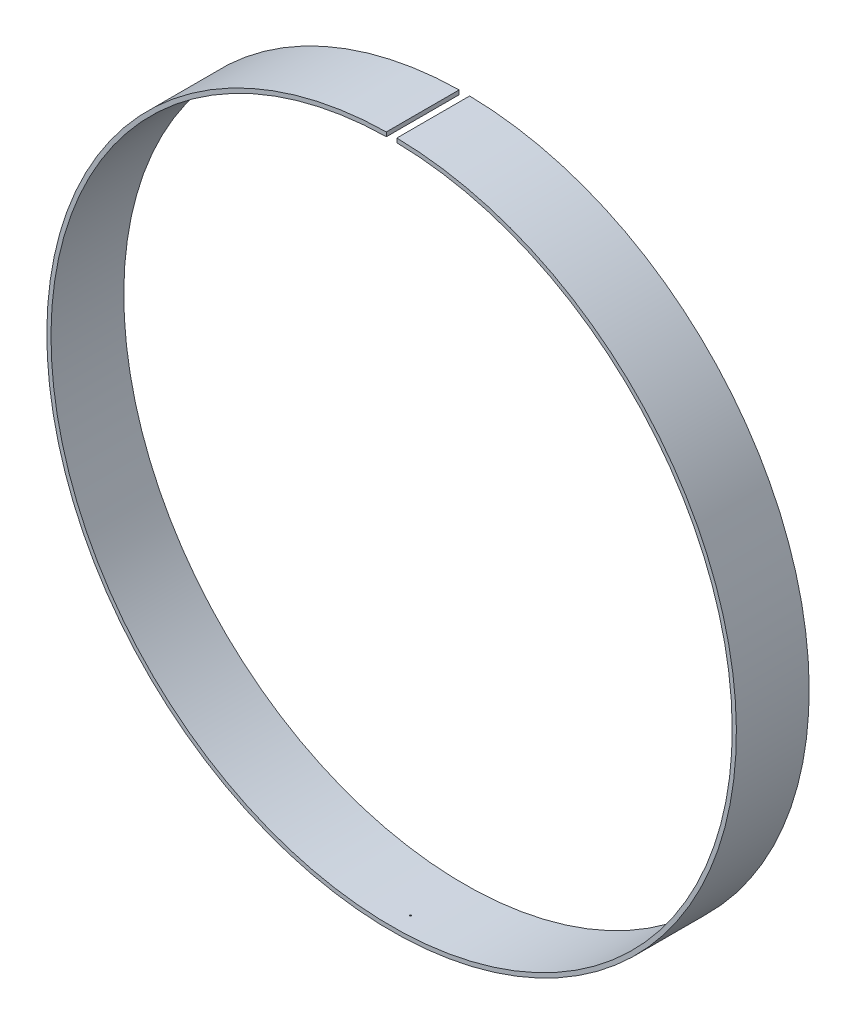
ISO-10303-21;
HEADER;
FILE_DESCRIPTION(('STEP AP214'),'2;1');
FILE_NAME('part.step','',(''),(''),'','','');
FILE_SCHEMA(('AUTOMOTIVE_DESIGN { 1 0 10303 214 1 1 1 1 }'));
ENDSEC;
DATA;
#1=APPLICATION_CONTEXT('core data for automotive mechanical design processes');
#2=APPLICATION_PROTOCOL_DEFINITION('international standard','automotive_design',2000,#1);
#3=PRODUCT_CONTEXT('',#1,'mechanical');
#4=PRODUCT('Part','Part','',(#3));
#5=PRODUCT_RELATED_PRODUCT_CATEGORY('part','',(#4));
#6=PRODUCT_DEFINITION_FORMATION('','',#4);
#7=PRODUCT_DEFINITION_CONTEXT('part definition',#1,'design');
#8=PRODUCT_DEFINITION('design','',#6,#7);
#9=PRODUCT_DEFINITION_SHAPE('','',#8);
#10=(LENGTH_UNIT() NAMED_UNIT(*) SI_UNIT(.MILLI.,.METRE.));
#11=(NAMED_UNIT(*) PLANE_ANGLE_UNIT() SI_UNIT($,.RADIAN.));
#12=(NAMED_UNIT(*) SI_UNIT($,.STERADIAN.) SOLID_ANGLE_UNIT());
#13=UNCERTAINTY_MEASURE_WITH_UNIT(LENGTH_MEASURE(1.E-05),#10,'distance_accuracy_value','');
#14=(GEOMETRIC_REPRESENTATION_CONTEXT(3) GLOBAL_UNCERTAINTY_ASSIGNED_CONTEXT((#13)) GLOBAL_UNIT_ASSIGNED_CONTEXT((#10,
#11,#12)) REPRESENTATION_CONTEXT('',''));
#15=CARTESIAN_POINT('',(0.,0.,0.));
#16=DIRECTION('',(0.,0.,1.));
#17=DIRECTION('',(1.,0.,0.));
#18=AXIS2_PLACEMENT_3D('',#15,#16,#17);
#19=CARTESIAN_POINT('',(0.,0.,-70.));
#20=DIRECTION('',(0.,0.,1.));
#21=DIRECTION('',(1.,0.,0.));
#22=AXIS2_PLACEMENT_3D('',#19,#20,#21);
#23=CYLINDRICAL_SURFACE('',#22,331.5);
#24=CARTESIAN_POINT('',(0.,0.,0.));
#25=DIRECTION('',(0.,0.,1.));
#26=DIRECTION('',(1.,0.,0.));
#27=AXIS2_PLACEMENT_3D('',#24,#25,#26);
#28=CIRCLE('',#27,331.5);
#29=CARTESIAN_POINT('',(-5.06106870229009,331.461363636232,0.));
#30=VERTEX_POINT('',#29);
#31=CARTESIAN_POINT('',(5.06106870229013,331.461363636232,0.));
#32=VERTEX_POINT('',#31);
#33=EDGE_CURVE('E117',#30,#32,#28,.T.);
#34=ORIENTED_EDGE('',*,*,#33,.F.);
#35=DIRECTION('',(0.,0.,1.));
#36=VECTOR('',#35,1.);
#37=CARTESIAN_POINT('',(-5.06106870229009,331.461363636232,-70.));
#38=LINE('',#37,#36);
#39=CARTESIAN_POINT('',(-5.06106870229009,331.461363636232,-70.));
#40=VERTEX_POINT('',#39);
#41=EDGE_CURVE('E11',#40,#30,#38,.T.);
#42=ORIENTED_EDGE('',*,*,#41,.F.);
#43=CARTESIAN_POINT('',(0.,0.,-70.));
#44=DIRECTION('',(0.,0.,1.));
#45=DIRECTION('',(1.,0.,0.));
#46=AXIS2_PLACEMENT_3D('',#43,#44,#45);
#47=CIRCLE('',#46,331.5);
#48=CARTESIAN_POINT('',(5.06106870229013,331.461363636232,-70.));
#49=VERTEX_POINT('',#48);
#50=EDGE_CURVE('E109',#40,#49,#47,.T.);
#51=ORIENTED_EDGE('',*,*,#50,.T.);
#52=DIRECTION('',(0.,0.,1.));
#53=VECTOR('',#52,1.);
#54=CARTESIAN_POINT('',(5.06106870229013,331.461363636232,-70.));
#55=LINE('',#54,#53);
#56=EDGE_CURVE('E47',#49,#32,#55,.T.);
#57=ORIENTED_EDGE('',*,*,#56,.T.);
#58=EDGE_LOOP('',(#34,#42,#51,#57));
#59=FACE_BOUND('',#58,.T.);
#60=CARTESIAN_POINT('',(0.,-331.5,-19.1724665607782));
#61=CARTESIAN_POINT('',(0.0392523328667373,-331.499999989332,-19.1724690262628));
#62=CARTESIAN_POINT('',(0.0785393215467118,-331.499992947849,-19.1758806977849));
#63=CARTESIAN_POINT('',(0.155980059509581,-331.49996557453,-19.189386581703));
#64=CARTESIAN_POINT('',(0.194132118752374,-331.499945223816,-19.1994902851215));
#65=CARTESIAN_POINT('',(0.268107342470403,-331.499893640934,-19.2259120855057));
#66=CARTESIAN_POINT('',(0.303935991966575,-331.499862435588,-19.2422148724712));
#67=CARTESIAN_POINT('',(0.372470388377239,-331.499792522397,-19.2803852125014));
#68=CARTESIAN_POINT('',(0.405176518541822,-331.499753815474,-19.3022520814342));
#69=CARTESIAN_POINT('',(0.467955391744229,-331.499671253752,-19.3517012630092));
#70=CARTESIAN_POINT('',(0.497882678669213,-331.499627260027,-19.3794677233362));
#71=CARTESIAN_POINT('',(0.553111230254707,-331.499539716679,-19.4392656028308));
#72=CARTESIAN_POINT('',(0.578410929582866,-331.499496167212,-19.4712984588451));
#73=CARTESIAN_POINT('',(0.626027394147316,-331.499409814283,-19.5417076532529));
#74=CARTESIAN_POINT('',(0.647885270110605,-331.499367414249,-19.5803942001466));
#75=CARTESIAN_POINT('',(0.685403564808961,-331.49929196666,-19.6606614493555));
#76=CARTESIAN_POINT('',(0.701061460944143,-331.499258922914,-19.7022433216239));
#77=CARTESIAN_POINT('',(0.727120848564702,-331.499202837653,-19.7910374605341));
#78=CARTESIAN_POINT('',(0.736935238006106,-331.499180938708,-19.8384224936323));
#79=CARTESIAN_POINT('',(0.748933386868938,-331.499154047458,-19.9341531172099));
#80=CARTESIAN_POINT('',(0.751114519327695,-331.499149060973,-19.9824990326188));
#81=CARTESIAN_POINT('',(0.747733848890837,-331.499156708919,-20.0816072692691));
#82=CARTESIAN_POINT('',(0.741737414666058,-331.499170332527,-20.1323554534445));
#83=CARTESIAN_POINT('',(0.721281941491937,-331.499215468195,-20.232132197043));
#84=CARTESIAN_POINT('',(0.706821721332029,-331.499246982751,-20.2811605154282));
#85=CARTESIAN_POINT('',(0.669698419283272,-331.49932405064,-20.3757644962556));
#86=CARTESIAN_POINT('',(0.647073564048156,-331.499369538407,-20.4213550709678));
#87=CARTESIAN_POINT('',(0.593959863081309,-331.499468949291,-20.5077187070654));
#88=CARTESIAN_POINT('',(0.563473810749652,-331.49952286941,-20.5484934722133));
#89=CARTESIAN_POINT('',(0.497605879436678,-331.499628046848,-20.6209620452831));
#90=CARTESIAN_POINT('',(0.462696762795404,-331.499679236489,-20.6530843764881));
#91=CARTESIAN_POINT('',(0.38747311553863,-331.499775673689,-20.7102201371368));
#92=CARTESIAN_POINT('',(0.347162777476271,-331.499820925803,-20.7352390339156));
#93=CARTESIAN_POINT('',(0.266645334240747,-331.499894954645,-20.7747899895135));
#94=CARTESIAN_POINT('',(0.226829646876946,-331.499924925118,-20.790119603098));
#95=CARTESIAN_POINT('',(0.145066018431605,-331.499970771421,-20.8132238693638));
#96=CARTESIAN_POINT('',(0.103119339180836,-331.49998665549,-20.8210029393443));
#97=CARTESIAN_POINT('',(0.0218689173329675,-331.500001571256,-20.8283068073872));
#98=CARTESIAN_POINT('',(-0.0173815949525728,-331.500001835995,-20.8284355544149));
#99=CARTESIAN_POINT('',(-0.0953158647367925,-331.499988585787,-20.821949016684));
#100=CARTESIAN_POINT('',(-0.133999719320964,-331.49997507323,-20.8153349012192));
#101=CARTESIAN_POINT('',(-0.208910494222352,-331.499936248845,-20.7958627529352));
#102=CARTESIAN_POINT('',(-0.245171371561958,-331.499911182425,-20.7831343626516));
#103=CARTESIAN_POINT('',(-0.315163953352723,-331.499852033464,-20.752007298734));
#104=CARTESIAN_POINT('',(-0.348895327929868,-331.499817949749,-20.733607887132));
#105=CARTESIAN_POINT('',(-0.414423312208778,-331.49974264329,-20.690932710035));
#106=CARTESIAN_POINT('',(-0.446081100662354,-331.499701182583,-20.6664443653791));
#107=CARTESIAN_POINT('',(-0.505228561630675,-331.499616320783,-20.6128751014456));
#108=CARTESIAN_POINT('',(-0.532716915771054,-331.499572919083,-20.5837927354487));
#109=CARTESIAN_POINT('',(-0.58517554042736,-331.499484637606,-20.5193256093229));
#110=CARTESIAN_POINT('',(-0.609749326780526,-331.499439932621,-20.4836184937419));
#111=CARTESIAN_POINT('',(-0.653146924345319,-331.499357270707,-20.4088706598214));
#112=CARTESIAN_POINT('',(-0.67196847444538,-331.499319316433,-20.3698286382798));
#113=CARTESIAN_POINT('',(-0.705116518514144,-331.499250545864,-20.285666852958));
#114=CARTESIAN_POINT('',(-0.718865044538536,-331.499220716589,-20.2403191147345));
#115=CARTESIAN_POINT('',(-0.739094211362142,-331.4991762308,-20.1480283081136));
#116=CARTESIAN_POINT('',(-0.745572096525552,-331.499161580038,-20.1010846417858));
#117=CARTESIAN_POINT('',(-0.751383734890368,-331.499148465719,-20.003564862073));
#118=CARTESIAN_POINT('',(-0.750205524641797,-331.499151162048,-19.9529575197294));
#119=CARTESIAN_POINT('',(-0.739492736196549,-331.499175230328,-19.8526228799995));
#120=CARTESIAN_POINT('',(-0.729956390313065,-331.499196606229,-19.802895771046));
#121=CARTESIAN_POINT('',(-0.702448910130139,-331.499256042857,-19.7051435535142));
#122=CARTESIAN_POINT('',(-0.684374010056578,-331.499294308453,-19.6571474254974));
#123=CARTESIAN_POINT('',(-0.639989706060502,-331.499382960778,-19.5651092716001));
#124=CARTESIAN_POINT('',(-0.613682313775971,-331.499433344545,-19.5210662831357));
#125=CARTESIAN_POINT('',(-0.554912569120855,-331.499536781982,-19.4408132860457));
#126=CARTESIAN_POINT('',(-0.522848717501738,-331.499589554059,-19.4043124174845));
#127=CARTESIAN_POINT('',(-0.452464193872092,-331.499693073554,-19.3379065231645));
#128=CARTESIAN_POINT('',(-0.414145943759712,-331.499743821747,-19.3079989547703));
#129=CARTESIAN_POINT('',(-0.336256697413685,-331.499831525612,-19.2587214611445));
#130=CARTESIAN_POINT('',(-0.297146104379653,-331.499869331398,-19.2386229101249));
#131=CARTESIAN_POINT('',(-0.21592028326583,-331.49993214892,-19.2060448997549));
#132=CARTESIAN_POINT('',(-0.173812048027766,-331.499957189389,-19.1935483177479));
#133=CARTESIAN_POINT('',(-0.109389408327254,-331.499982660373,-19.1809493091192));
#134=CARTESIAN_POINT('',(-0.0876370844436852,-331.499989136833,-19.177773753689));
#135=CARTESIAN_POINT('',(-0.0439267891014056,-331.499997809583,-19.1735317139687));
#136=CARTESIAN_POINT('',(-0.0219688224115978,-331.500000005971,-19.172465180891));
#137=CARTESIAN_POINT('',(0.,-331.5,-19.1724665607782));
#138=B_SPLINE_CURVE_WITH_KNOTS('',3,(#60,#61,#62,#63,#64,#65,#66,#67,#68,#69,#70,#71,#72,#73,
#74,#75,#76,#77,#78,#79,#80,#81,#82,#83,#84,#85,#86,#87,#88,#89,#90,#91,#92,#93,#94,#95,#96,#97,
#98,#99,#100,#101,#102,#103,#104,#105,#106,#107,#108,#109,#110,#111,#112,#113,#114,#115,#116,
#117,#118,#119,#120,#121,#122,#123,#124,#125,#126,#127,#128,#129,#130,#131,#132,#133,#134,#135,
#136,#137),.UNSPECIFIED.,.T.,.F.,(4,2,2,2,2,2,2,2,2,2,2,2,2,2,2,2,2,2,2,2,2,2,2,2,2,2,2,2,2,2,2,
2,2,2,2,2,2,2,4),(0.,0.117671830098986,0.235510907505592,0.353060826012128,0.470596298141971,
0.592555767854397,0.714556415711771,0.847300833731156,0.980099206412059,1.12463821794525,
1.26922696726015,1.4218074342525,1.57440920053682,1.72630556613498,1.8781480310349,
2.01968404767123,2.16111083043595,2.28841916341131,2.41565297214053,2.53282787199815,
2.64998245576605,2.76475582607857,2.87954413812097,2.99910669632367,3.11870698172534,
3.24820223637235,3.37774832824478,3.51929583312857,3.66089696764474,3.81206005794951,
3.96325512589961,4.11633682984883,4.26938115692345,4.41434169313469,4.55924622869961,
4.69046023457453,4.82137758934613,4.88723791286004,4.95309671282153),.UNSPECIFIED.);
#139=CARTESIAN_POINT('',(0.,-331.5,-19.1724665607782));
#140=VERTEX_POINT('',#139);
#141=EDGE_CURVE('E137',#140,#140,#138,.T.);
#142=ORIENTED_EDGE('',*,*,#141,.T.);
#143=EDGE_LOOP('',(#142));
#144=FACE_BOUND('',#143,.T.);
#145=ADVANCED_FACE('F44',(#59,#144),#23,.T.);
#146=CARTESIAN_POINT('',(0.,0.,-70.));
#147=DIRECTION('',(0.,0.,1.));
#148=DIRECTION('',(1.,0.,0.));
#149=AXIS2_PLACEMENT_3D('',#146,#147,#148);
#150=CYLINDRICAL_SURFACE('',#149,327.5);
#151=CARTESIAN_POINT('',(0.,0.,0.));
#152=DIRECTION('',(0.,0.,1.));
#153=DIRECTION('',(1.,0.,0.));
#154=AXIS2_PLACEMENT_3D('',#151,#152,#153);
#155=CIRCLE('',#154,327.5);
#156=CARTESIAN_POINT('',(-5.00000000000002,327.4618298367,0.));
#157=VERTEX_POINT('',#156);
#158=CARTESIAN_POINT('',(5.00000000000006,327.4618298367,0.));
#159=VERTEX_POINT('',#158);
#160=EDGE_CURVE('E102',#157,#159,#155,.T.);
#161=ORIENTED_EDGE('',*,*,#160,.T.);
#162=DIRECTION('',(0.,0.,1.));
#163=VECTOR('',#162,1.);
#164=CARTESIAN_POINT('',(5.00000000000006,327.4618298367,-70.));
#165=LINE('',#164,#163);
#166=CARTESIAN_POINT('',(5.00000000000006,327.4618298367,-70.));
#167=VERTEX_POINT('',#166);
#168=EDGE_CURVE('E98',#167,#159,#165,.T.);
#169=ORIENTED_EDGE('',*,*,#168,.F.);
#170=CARTESIAN_POINT('',(0.,0.,-70.));
#171=DIRECTION('',(0.,0.,1.));
#172=DIRECTION('',(1.,0.,0.));
#173=AXIS2_PLACEMENT_3D('',#170,#171,#172);
#174=CIRCLE('',#173,327.5);
#175=CARTESIAN_POINT('',(-5.00000000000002,327.4618298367,-70.));
#176=VERTEX_POINT('',#175);
#177=EDGE_CURVE('E90',#176,#167,#174,.T.);
#178=ORIENTED_EDGE('',*,*,#177,.F.);
#179=DIRECTION('',(0.,0.,1.));
#180=VECTOR('',#179,1.);
#181=CARTESIAN_POINT('',(-5.00000000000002,327.4618298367,-70.));
#182=LINE('',#181,#180);
#183=EDGE_CURVE('E54',#176,#157,#182,.T.);
#184=ORIENTED_EDGE('',*,*,#183,.T.);
#185=EDGE_LOOP('',(#161,#169,#178,#184));
#186=FACE_BOUND('',#185,.T.);
#187=CARTESIAN_POINT('',(0.749997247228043,-327.499141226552,-18.1366110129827));
#188=CARTESIAN_POINT('',(0.750118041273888,-327.499140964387,-18.0863447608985));
#189=CARTESIAN_POINT('',(0.74608490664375,-327.499150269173,-18.0360183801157));
#190=CARTESIAN_POINT('',(0.729712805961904,-327.499187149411,-17.9366342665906));
#191=CARTESIAN_POINT('',(0.717354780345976,-327.499214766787,-17.8875797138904));
#192=CARTESIAN_POINT('',(0.684424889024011,-327.499285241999,-17.7922027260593));
#193=CARTESIAN_POINT('',(0.663840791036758,-327.499328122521,-17.7458844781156));
#194=CARTESIAN_POINT('',(0.61476182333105,-327.499423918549,-17.6576586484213));
#195=CARTESIAN_POINT('',(0.586272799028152,-327.49947682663,-17.6157478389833));
#196=CARTESIAN_POINT('',(0.523705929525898,-327.499582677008,-17.5401134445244));
#197=CARTESIAN_POINT('',(0.490019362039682,-327.499635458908,-17.5060672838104));
#198=CARTESIAN_POINT('',(0.416870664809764,-327.499736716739,-17.4448611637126));
#199=CARTESIAN_POINT('',(0.377412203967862,-327.499785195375,-17.4176968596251));
#200=CARTESIAN_POINT('',(0.297996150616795,-327.499866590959,-17.373876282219));
#201=CARTESIAN_POINT('',(0.258460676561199,-327.499900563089,-17.3564547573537));
#202=CARTESIAN_POINT('',(0.176862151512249,-327.499954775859,-17.3291813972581));
#203=CARTESIAN_POINT('',(0.134800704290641,-327.499975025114,-17.3193248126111));
#204=CARTESIAN_POINT('',(0.0531066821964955,-327.49999803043,-17.3081677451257));
#205=CARTESIAN_POINT('',(0.0135603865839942,-327.500002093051,-17.3062278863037));
#206=CARTESIAN_POINT('',(-0.0652654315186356,-327.499995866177,-17.309226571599));
#207=CARTESIAN_POINT('',(-0.104545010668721,-327.499985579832,-17.3141636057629));
#208=CARTESIAN_POINT('',(-0.180587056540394,-327.499952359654,-17.3304556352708));
#209=CARTESIAN_POINT('',(-0.217389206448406,-327.499929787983,-17.3416270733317));
#210=CARTESIAN_POINT('',(-0.288685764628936,-327.499874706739,-17.3697945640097));
#211=CARTESIAN_POINT('',(-0.323179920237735,-327.499842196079,-17.3867912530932));
#212=CARTESIAN_POINT('',(-0.390174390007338,-327.499769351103,-17.4266395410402));
#213=CARTESIAN_POINT('',(-0.422568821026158,-327.499728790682,-17.4496686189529));
#214=CARTESIAN_POINT('',(-0.483379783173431,-327.499644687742,-17.5004726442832));
#215=CARTESIAN_POINT('',(-0.511795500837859,-327.499601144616,-17.5282485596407));
#216=CARTESIAN_POINT('',(-0.566200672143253,-327.499511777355,-17.5900091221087));
#217=CARTESIAN_POINT('',(-0.591833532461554,-327.499466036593,-17.6243075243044));
#218=CARTESIAN_POINT('',(-0.637559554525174,-327.499380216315,-17.6964346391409));
#219=CARTESIAN_POINT('',(-0.657648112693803,-327.499340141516,-17.7342662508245));
#220=CARTESIAN_POINT('',(-0.693633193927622,-327.499265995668,-17.8161105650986));
#221=CARTESIAN_POINT('',(-0.708966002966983,-327.499232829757,-17.8603708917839));
#222=CARTESIAN_POINT('',(-0.732520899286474,-327.499180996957,-17.9506719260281));
#223=CARTESIAN_POINT('',(-0.740754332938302,-327.499162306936,-17.9967096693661));
#224=CARTESIAN_POINT('',(-0.748549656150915,-327.499144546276,-18.0741502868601));
#225=CARTESIAN_POINT('',(-0.750075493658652,-327.499141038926,-18.1053742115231));
#226=CARTESIAN_POINT('',(-0.74987125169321,-327.499141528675,-18.1869097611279));
#227=CARTESIAN_POINT('',(-0.745586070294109,-327.499151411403,-18.2372418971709));
#228=CARTESIAN_POINT('',(-0.728711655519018,-327.499189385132,-18.3365951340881));
#229=CARTESIAN_POINT('',(-0.716103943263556,-327.499217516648,-18.3856130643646));
#230=CARTESIAN_POINT('',(-0.682686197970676,-327.499288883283,-18.4808752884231));
#231=CARTESIAN_POINT('',(-0.661863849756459,-327.499332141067,-18.527115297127));
#232=CARTESIAN_POINT('',(-0.612326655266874,-327.499428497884,-18.6151456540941));
#233=CARTESIAN_POINT('',(-0.583617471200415,-327.499481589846,-18.6569391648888));
#234=CARTESIAN_POINT('',(-0.52064198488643,-327.499587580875,-18.7323076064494));
#235=CARTESIAN_POINT('',(-0.48676524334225,-327.49964033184,-18.7662069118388));
#236=CARTESIAN_POINT('',(-0.413260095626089,-327.499741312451,-18.8270760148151));
#237=CARTESIAN_POINT('',(-0.373635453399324,-327.499789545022,-18.8540503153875));
#238=CARTESIAN_POINT('',(-0.293982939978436,-327.499870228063,-18.8974363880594));
#239=CARTESIAN_POINT('',(-0.254379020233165,-327.49990376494,-18.9146267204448));
#240=CARTESIAN_POINT('',(-0.172684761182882,-327.499957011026,-18.9414172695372));
#241=CARTESIAN_POINT('',(-0.130596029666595,-327.499976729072,-18.951022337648));
#242=CARTESIAN_POINT('',(-0.0489492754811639,-327.499998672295,-18.9616773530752));
#243=CARTESIAN_POINT('',(-0.00947496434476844,-327.500002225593,-18.9633771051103));
#244=CARTESIAN_POINT('',(0.0691665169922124,-327.499995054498,-18.9599162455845));
#245=CARTESIAN_POINT('',(0.108333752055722,-327.499984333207,-18.954757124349));
#246=CARTESIAN_POINT('',(0.184131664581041,-327.499950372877,-18.9380541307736));
#247=CARTESIAN_POINT('',(0.220802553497,-327.499927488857,-18.9266911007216));
#248=CARTESIAN_POINT('',(0.291812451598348,-327.499871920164,-18.898174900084));
#249=CARTESIAN_POINT('',(0.326151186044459,-327.499839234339,-18.8810210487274));
#250=CARTESIAN_POINT('',(0.392877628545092,-327.499766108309,-18.8408582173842));
#251=CARTESIAN_POINT('',(0.425153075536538,-327.499725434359,-18.8176632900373));
#252=CARTESIAN_POINT('',(0.48571109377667,-327.49964122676,-18.7665577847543));
#253=CARTESIAN_POINT('',(0.51399283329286,-327.499597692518,-18.7386462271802));
#254=CARTESIAN_POINT('',(0.568170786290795,-327.499508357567,-18.6765718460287));
#255=CARTESIAN_POINT('',(0.59369958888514,-327.499462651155,-18.6420887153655));
#256=CARTESIAN_POINT('',(0.639197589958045,-327.499377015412,-18.5696125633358));
#257=CARTESIAN_POINT('',(0.659162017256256,-327.499337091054,-18.5316165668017));
#258=CARTESIAN_POINT('',(0.694888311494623,-327.499263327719,-18.449407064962));
#259=CARTESIAN_POINT('',(0.710077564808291,-327.499230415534,-18.4049449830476));
#260=CARTESIAN_POINT('',(0.733308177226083,-327.499179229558,-18.314265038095));
#261=CARTESIAN_POINT('',(0.74136156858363,-327.49916093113,-18.2680502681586));
#262=CARTESIAN_POINT('',(0.748538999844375,-327.499144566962,-18.1933053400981));
#263=CARTESIAN_POINT('',(0.74992910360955,-327.499141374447,-18.1649677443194));
#264=CARTESIAN_POINT('',(0.749997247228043,-327.499141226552,-18.1366110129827));
#265=B_SPLINE_CURVE_WITH_KNOTS('',3,(#187,#188,#189,#190,#191,#192,#193,#194,#195,#196,#197,
#198,#199,#200,#201,#202,#203,#204,#205,#206,#207,#208,#209,#210,#211,#212,#213,#214,#215,#216,
#217,#218,#219,#220,#221,#222,#223,#224,#225,#226,#227,#228,#229,#230,#231,#232,#233,#234,#235,
#236,#237,#238,#239,#240,#241,#242,#243,#244,#245,#246,#247,#248,#249,#250,#251,#252,#253,#254,
#255,#256,#257,#258,#259,#260,#261,#262,#263,#264),.UNSPECIFIED.,.T.,.F.,(4,2,2,2,2,2,2,2,2,2,2,
2,2,2,2,2,2,2,2,2,2,2,2,2,2,2,2,2,2,2,2,2,2,2,2,2,2,2,4),(0.,0.150713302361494,
0.301772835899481,0.453057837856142,0.604231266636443,0.747129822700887,0.889937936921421,
1.01885102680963,1.1476831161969,1.26587570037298,1.3840423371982,1.49890059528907,
1.61377140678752,1.73250048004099,1.85125379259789,1.9791736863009,2.10719947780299,
2.24713342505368,2.38684331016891,2.48049380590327,2.631293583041,2.78242931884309,
2.93379249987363,3.0850472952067,3.228033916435,3.37092732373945,3.49974946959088,
3.62848915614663,3.74643421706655,3.86435365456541,3.97900626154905,4.09367235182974,
4.21240188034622,4.33115609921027,4.45933425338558,4.58762197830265,4.72798756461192,
4.86811601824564,4.95313800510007),.UNSPECIFIED.);
#266=CARTESIAN_POINT('',(0.749997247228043,-327.499141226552,-18.1366110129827));
#267=VERTEX_POINT('',#266);
#268=EDGE_CURVE('E122',#267,#267,#265,.T.);
#269=ORIENTED_EDGE('',*,*,#268,.T.);
#270=EDGE_LOOP('',(#269));
#271=FACE_BOUND('',#270,.T.);
#272=ADVANCED_FACE('F99',(#186,#271),#150,.F.);
#273=CARTESIAN_POINT('',(-5.06106870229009,331.461363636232,-70.));
#274=DIRECTION('',(-0.999883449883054,-0.0152671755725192,0.));
#275=DIRECTION('',(0.0152671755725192,-0.999883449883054,0.));
#276=AXIS2_PLACEMENT_3D('',#273,#274,#275);
#277=PLANE('',#276);
#278=DIRECTION('',(0.0152671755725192,-0.999883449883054,0.));
#279=VECTOR('',#278,1.);
#280=CARTESIAN_POINT('',(-5.06106870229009,331.461363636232,0.));
#281=LINE('',#280,#279);
#282=EDGE_CURVE('E78',#30,#157,#281,.T.);
#283=ORIENTED_EDGE('',*,*,#282,.T.);
#284=ORIENTED_EDGE('',*,*,#183,.F.);
#285=DIRECTION('',(0.0152671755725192,-0.999883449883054,0.));
#286=VECTOR('',#285,1.);
#287=CARTESIAN_POINT('',(-5.06106870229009,331.461363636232,-70.));
#288=LINE('',#287,#286);
#289=EDGE_CURVE('E93',#40,#176,#288,.T.);
#290=ORIENTED_EDGE('',*,*,#289,.F.);
#291=ORIENTED_EDGE('',*,*,#41,.T.);
#292=EDGE_LOOP('',(#283,#284,#290,#291));
#293=FACE_BOUND('',#292,.T.);
#294=ADVANCED_FACE('F165',(#293),#277,.F.);
#295=CARTESIAN_POINT('',(5.00000000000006,327.4618298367,-70.));
#296=DIRECTION('',(0.999883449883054,-0.0152671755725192,0.));
#297=DIRECTION('',(0.0152671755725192,0.999883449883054,0.));
#298=AXIS2_PLACEMENT_3D('',#295,#296,#297);
#299=PLANE('',#298);
#300=DIRECTION('',(0.0152671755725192,0.999883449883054,0.));
#301=VECTOR('',#300,1.);
#302=CARTESIAN_POINT('',(5.00000000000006,327.4618298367,0.));
#303=LINE('',#302,#301);
#304=EDGE_CURVE('E121',#159,#32,#303,.T.);
#305=ORIENTED_EDGE('',*,*,#304,.T.);
#306=ORIENTED_EDGE('',*,*,#56,.F.);
#307=DIRECTION('',(0.0152671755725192,0.999883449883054,0.));
#308=VECTOR('',#307,1.);
#309=CARTESIAN_POINT('',(5.00000000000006,327.4618298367,-70.));
#310=LINE('',#309,#308);
#311=EDGE_CURVE('E87',#167,#49,#310,.T.);
#312=ORIENTED_EDGE('',*,*,#311,.F.);
#313=ORIENTED_EDGE('',*,*,#168,.T.);
#314=EDGE_LOOP('',(#305,#306,#312,#313));
#315=FACE_BOUND('',#314,.T.);
#316=ADVANCED_FACE('F107',(#315),#299,.F.);
#317=CARTESIAN_POINT('',(0.,0.,-70.));
#318=DIRECTION('',(0.,0.,1.));
#319=DIRECTION('',(1.,0.,0.));
#320=AXIS2_PLACEMENT_3D('',#317,#318,#319);
#321=PLANE('',#320);
#322=ORIENTED_EDGE('',*,*,#50,.F.);
#323=ORIENTED_EDGE('',*,*,#289,.T.);
#324=ORIENTED_EDGE('',*,*,#177,.T.);
#325=ORIENTED_EDGE('',*,*,#311,.T.);
#326=EDGE_LOOP('',(#322,#323,#324,#325));
#327=FACE_BOUND('',#326,.T.);
#328=ADVANCED_FACE('F92',(#327),#321,.F.);
#329=CARTESIAN_POINT('',(0.,0.,0.));
#330=DIRECTION('',(0.,0.,1.));
#331=DIRECTION('',(1.,0.,0.));
#332=AXIS2_PLACEMENT_3D('',#329,#330,#331);
#333=PLANE('',#332);
#334=ORIENTED_EDGE('',*,*,#33,.T.);
#335=ORIENTED_EDGE('',*,*,#304,.F.);
#336=ORIENTED_EDGE('',*,*,#160,.F.);
#337=ORIENTED_EDGE('',*,*,#282,.F.);
#338=EDGE_LOOP('',(#334,#335,#336,#337));
#339=FACE_BOUND('',#338,.T.);
#340=ADVANCED_FACE('F131',(#339),#333,.T.);
#341=CARTESIAN_POINT('',(0.,220.714005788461,237.501619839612));
#342=DIRECTION('',(0.,-0.906307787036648,-0.422618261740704));
#343=DIRECTION('',(0.,0.422618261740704,-0.906307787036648));
#344=AXIS2_PLACEMENT_3D('',#341,#342,#343);
#345=CYLINDRICAL_SURFACE('',#344,0.750000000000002);
#346=ORIENTED_EDGE('',*,*,#268,.F.);
#347=EDGE_LOOP('',(#346));
#348=FACE_BOUND('',#347,.T.);
#349=ORIENTED_EDGE('',*,*,#141,.F.);
#350=EDGE_LOOP('',(#349));
#351=FACE_BOUND('',#350,.T.);
#352=ADVANCED_FACE('F156',(#348,#351),#345,.F.);
#353=CLOSED_SHELL('',(#145,#272,#294,#316,#328,#340,#352));
#354=MANIFOLD_SOLID_BREP('B2',#353);
#355=ADVANCED_BREP_SHAPE_REPRESENTATION('',(#18,#354),#14);
#356=SHAPE_DEFINITION_REPRESENTATION(#9,#355);
ENDSEC;
END-ISO-10303-21;
